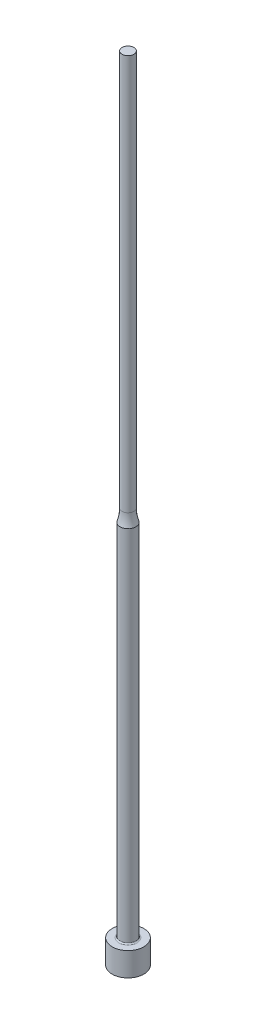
from build123d import *


with BuildPart() as part:
    # Sketch1 → Revolve1 (revolve)
    with BuildSketch(Plane.XY, mode=Mode.PRIVATE) as revolve1_sk:
        with BuildLine():
            Line((0, 0), (4, 0))
            Line((4, 0), (4, 6))
            Line((4, 6), (2.3, 6))
            ThreePointArc((2.3, 6), (2.087867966, 6.087867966), (2, 6.3))
            Line((2, 6.3), (2, 96.877501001))
            ThreePointArc((2, 96.877501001), (1.625791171, 98.41886117), (1.5, 100))
            Line((1.5, 100), (1.5, 200))
            Line((1.5, 200), (0, 200))
            Line((0, 200), (0, 0))
        make_face()
    revolve(revolve1_sk.sketch.rotate(Axis((0, 200, 0), (0, -1, 0)), 180), axis=Axis((0, 200, 0), (0, -1, 0)))


solid = part.part
